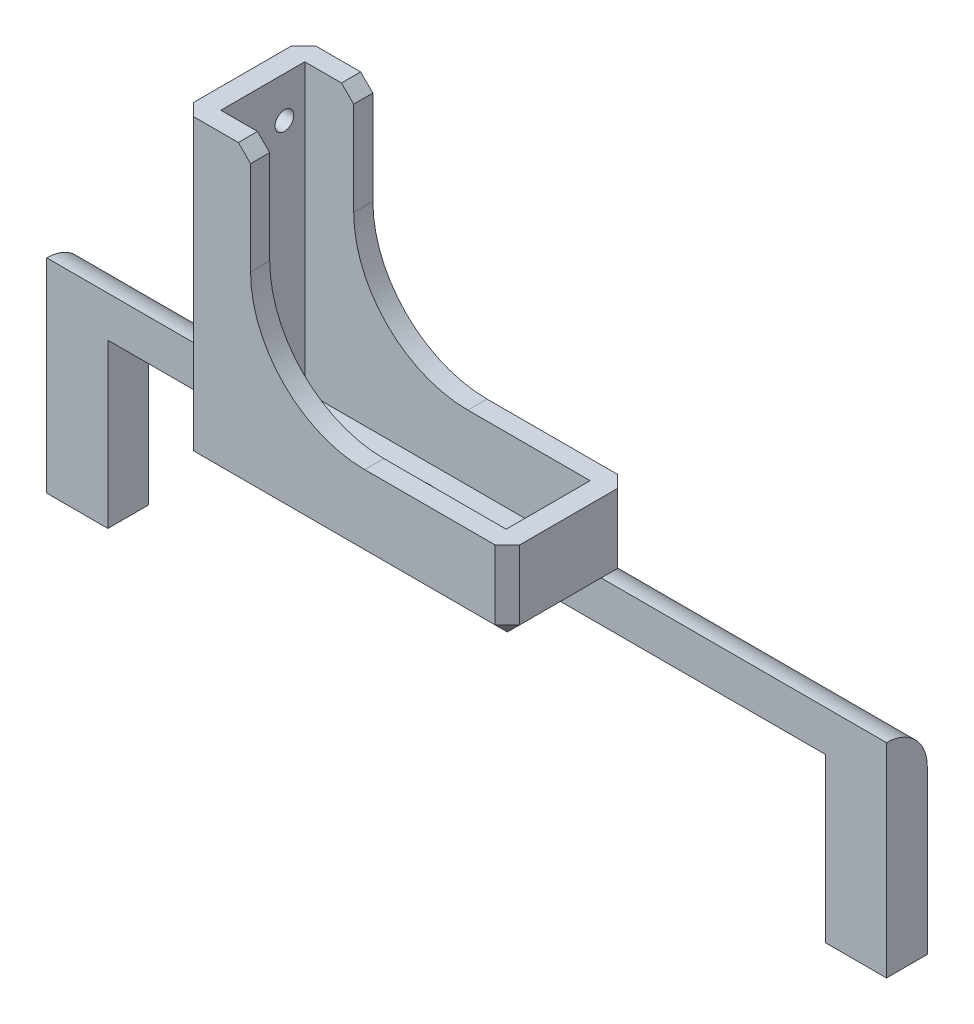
from build123d import *

# Parameters (mm, degrees)
SKETCH_1_W               = 15
SKETCH_1_H               = 8
EXTRUDE_1_DEPTH          = 7
SKETCH_4_W               = 40
SKETCH_4_H               = 15
EXTRUDE_3_DEPTH          = 2
SKETCH_5_W               = 40
SKETCH_5_H               = 15
SKETCH_5_W_2             = 35
SKETCH_5_H_2             = 10.3
EXTRUDE_4_DEPTH          = 35
SKETCH_6_W               = 23
SKETCH_6_H               = 27
CUT_EXTRUDE_1_DEPTH      = 49.877397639
CUT_EXTRUDE_3_REACH      = 61.034
SKETCH_8_R               = 1.15
SKETCH_9_R               = 2.5
CUT_EXTRUDE_4_DEPTH      = 0.1
SKETCH_11_W              = 8
SKETCH_11_H              = 20
EXTRUDE_6_DEPTH          = 15
CUT_EXTRUDE_5_DEPTH      = 49.877397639
CUT_EXTRUDE_5_DEPTH_BACK = 49.877397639
SKETCH_12_W              = 9
SKETCH_12_H              = 24.5
CUT_EXTRUDE_6_REACH      = 68.068
SKETCH_13_R              = 3
SKETCH_14_W              = 25.13622769
SKETCH_14_H              = 29.01993669
CUT_EXTRUDE_7_DEPTH      = 27
FILLET_1_R               = 14
CHAMFER_1_SIZE           = 1.5
SKETCH_17_W              = 8
SKETCH_17_H              = 23
CUT_EXTRUDE_8_DEPTH      = 20
EXTRUDE_7_REACH          = 53.393
SKETCH_19_R              = 3
CUT_EXTRUDE_9_DEPTH      = 10
SKETCH_20_W              = 15
SKETCH_20_H              = 5
CUT_EXTRUDE_10_DEPTH     = 20
EXTRUDE_8_DEPTH          = 44
EXTRUDE_START            = 44
EXTRUDE_9_DEPTH          = 44
SKETCH_23_W              = 7.5
SKETCH_23_H              = 5
EXTRUDE_10_DEPTH         = 20


with BuildPart() as part:
    # Sketch 1 → Extrude 1 (new body)
    with BuildSketch(Plane(origin=(0, 0, 0), x_dir=(1, 0, 0), z_dir=(0, 1, 0))):
        Rectangle(SKETCH_1_W, SKETCH_1_H)
    extrude(amount=EXTRUDE_1_DEPTH)

    # Sketch 4 → Extrude 3 (add)
    with BuildSketch(Plane(origin=(0, 7, 0), x_dir=(1, 0, 0), z_dir=(0, 1, 0))):
        with Locations((0, -3.5)):
            Rectangle(SKETCH_4_W, SKETCH_4_H)
    extrude(amount=-EXTRUDE_3_DEPTH)

    # Sketch 5 → Extrude 4 (add)
    with BuildSketch(Plane(origin=(0, 7, 0), x_dir=(1, 0, 0), z_dir=(0, 1, 0))):
        with Locations((0, -3.5)):
            Rectangle(SKETCH_5_W, SKETCH_5_H)
        with Locations((0, -3.5)):
            Rectangle(SKETCH_5_W_2, SKETCH_5_H_2, mode=Mode.SUBTRACT)
    extrude(amount=EXTRUDE_4_DEPTH)

    # Sketch 6 → Cut-Extrude 1 (cut, through all)
    with BuildSketch(Plane(origin=(0, 0, -4), x_dir=(-1, 0, 0), z_dir=(0, 0, -1))):
        with Locations((0, 28.5)):
            Rectangle(SKETCH_6_W, SKETCH_6_H)
    extrude(amount=-CUT_EXTRUDE_1_DEPTH, mode=Mode.SUBTRACT)

    # Sketch 8 → Cut-Extrude 3 (cut, up to next)
    with BuildSketch(Plane.ZY.offset(20), mode=Mode.PRIVATE) as cut_extrude_3_sk1:
        with Locations((0.85, 37)):
            Circle(SKETCH_8_R)
    cut_extrude_3_tool1 = extrude(cut_extrude_3_sk1.sketch, amount=-CUT_EXTRUDE_3_REACH, mode=Mode.PRIVATE) & part.part
    cut_extrude_3 = cut_extrude_3_tool1.solids().sort_by_distance((-20, 37, 0.85))[0]
    add(cut_extrude_3, mode=Mode.SUBTRACT)

    # Sketch 9 → Cut-Extrude 4 (cut)
    with BuildSketch(Plane.ZY.offset(20)):
        with Locations((0.85, 37)):
            Circle(SKETCH_9_R)
    cut_extrude_4 = extrude(amount=-CUT_EXTRUDE_4_DEPTH, mode=Mode.SUBTRACT)

    # Mirror 2: Cut-Extrude 3, Cut-Extrude 4 across plane
    add(cut_extrude_3.mirror(Plane(origin=(0, 0, 0), x_dir=(0, 0, 1), z_dir=(1, 0, 0))), mode=Mode.SUBTRACT)
    add(cut_extrude_4.mirror(Plane(origin=(0, 0, 0), x_dir=(0, 0, 1), z_dir=(1, 0, 0))), mode=Mode.SUBTRACT)

    # Sketch 11 → Extrude 6 (add)
    with BuildSketch(Plane.ZY.offset(7.5)):
        with Locations((0, -10)):
            Rectangle(SKETCH_11_W, SKETCH_11_H)
    extrude(amount=-EXTRUDE_6_DEPTH)

    # Sketch 12 → Cut-Extrude 5 (cut, two sides: drawn at the far end of the back side and taken through both)
    with BuildSketch(Plane(origin=(0, 0, -4), x_dir=(-1, 0, 0), z_dir=(0, 0, -1)).offset(-CUT_EXTRUDE_5_DEPTH_BACK)):
        with Locations((0, -7.25)):
            Rectangle(SKETCH_12_W, SKETCH_12_H)
    extrude(amount=CUT_EXTRUDE_5_DEPTH + CUT_EXTRUDE_5_DEPTH_BACK, mode=Mode.SUBTRACT)

    # Sketch 13 → Cut-Extrude 6 (cut, up to next)
    with BuildSketch(Plane(origin=(0, -20, 0), x_dir=(-1, 0, 0), z_dir=(0, -1, 0)), mode=Mode.PRIVATE) as cut_extrude_6_sk1:
        with Locations((0, 4)):
            Circle(SKETCH_13_R)
    cut_extrude_6_tool1 = extrude(cut_extrude_6_sk1.sketch, amount=-CUT_EXTRUDE_6_REACH, mode=Mode.PRIVATE) & part.part
    add(cut_extrude_6_tool1.solids().sort_by_distance((0, -20, -4))[0], mode=Mode.SUBTRACT)

    # Sketch 14 → Cut-Extrude 7 (cut)
    with BuildSketch(Plane(origin=(0, 42, 0), x_dir=(1, 0, 0), z_dir=(0, 1, 0))):
        with Locations((17.856096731, -2.844710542)):
            Rectangle(SKETCH_14_W, SKETCH_14_H)
    extrude(amount=-CUT_EXTRUDE_7_DEPTH, mode=Mode.SUBTRACT)

    # Fillet 1
    fillet_1_edges = [part.edges().sort_by_distance(p)[0] for p in [
        (-11.5, 15, -2.825),
        (-11.5, 15, 9.825),
    ]]
    fillet(fillet_1_edges, radius=FILLET_1_R)

    # Chamfer 1
    chamfer_1_edges = [part.edges().sort_by_distance(p)[0] for p in [
        (6, 5, 4),
        (-4.5, 5, 0),
        (4.5, 5, 0),
        (-6, 5, 4),
        (7.5, 5, 0),
        (-7.5, 5, 0),
        (-20, 23.5, -4),
        (20, 5, 3.5),
        (20, 10, -4),
        (0, 5, 11),
        (20, 10, 11),
        (-20, 5, 3.5),
        (-20, 23.5, 11),
        (-11.5, 42, -2.825),
        (-11.5, 42, 9.825),
    ]]
    chamfer(chamfer_1_edges, length=CHAMFER_1_SIZE)

    # Sketch 17 → Cut-Extrude 8 (cut)
    with BuildSketch(Plane(origin=(7.5, 0, 0), x_dir=(0, 0, -1), z_dir=(1, 0, 0))):
        with Locations((0, -8.5)):
            Rectangle(SKETCH_17_W, SKETCH_17_H)
    extrude(amount=-CUT_EXTRUDE_8_DEPTH, mode=Mode.SUBTRACT)

    # Extrude 7: up to this face of the body (flat: up to its plane)
    extrude_7_end = Plane(part.part.faces().sort_by_distance((-7.5, 3.25, 0))[0])
    # Sketch 18 → Extrude 7 (add, up to the picked face)
    with BuildSketch(Plane(origin=(7.5, 0, 0), x_dir=(0, 0, -1), z_dir=(1, 0, 0)), mode=Mode.PRIVATE) as extrude_7_sk1:
        with BuildLine():
            Line((4, -22), (9, -22))
            Line((9, -22), (9, -2))
            ThreePointArc((9, -2), (7.535533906, 1.535533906), (4, 3))
            Line((4, 3), (-4, 3))
            ThreePointArc((-4, 3), (-0.313739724, 0.663360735), (4, 0))
            Line((4, 0), (4, -22))
        make_face()
    extrude_7_tool1 = split(extrude(extrude_7_sk1.sketch, amount=-EXTRUDE_7_REACH, mode=Mode.PRIVATE), bisect_by=extrude_7_end, keep=Keep.BOTH, mode=Mode.PRIVATE)
    add(extrude_7_tool1.solids().sort_by(Axis((7.5, -8.537234, -5.743708), (-1, 0, 0)))[0])

    # Sketch 19 → Cut-Extrude 9 (cut)
    with BuildSketch(Plane(origin=(0, 7, 0), x_dir=(1, 0, 0), z_dir=(0, 1, 0))):
        with Locations(Location((0, -3.597722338, 0), (0, 0, 270))):
            Circle(SKETCH_19_R)
    extrude(amount=-CUT_EXTRUDE_9_DEPTH, mode=Mode.SUBTRACT)

    # Sketch 20 → Cut-Extrude 10 (cut)
    with BuildSketch(Plane.XZ.offset(22)):
        with Locations((0, -6.5)):
            Rectangle(SKETCH_20_W, SKETCH_20_H)
    extrude(amount=-CUT_EXTRUDE_10_DEPTH, mode=Mode.SUBTRACT)

    # Sketch 21 → Extrude 8 (add)
    with BuildSketch(Plane.ZY.offset(7.5)):
        with BuildLine():
            Line((-4, 3), (-4, -2))
            Line((-4, -2), (-9, -2))
            ThreePointArc((-9, -2), (-7.535533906, 1.535533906), (-4, 3))
        make_face()
    extrude(amount=EXTRUDE_8_DEPTH)

    # Sketch 22 → Extrude 9 (add)
    with BuildSketch(Plane(origin=(7.5, 0, 0), x_dir=(0, 0, -1), z_dir=(1, 0, 0)).offset(EXTRUDE_START)):
        with BuildLine():
            Line((4, -2), (9, -2))
            ThreePointArc((9, -2), (7.535533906, 1.535533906), (4, 3))
            Line((4, 3), (4, -2))
        make_face()
    extrude(amount=-EXTRUDE_9_DEPTH)

    # Sketch 23 → Extrude 10 (add)
    with BuildSketch(Plane.XZ.offset(2)):
        with Locations((-47.75, -6.5)):
            Rectangle(SKETCH_23_W, SKETCH_23_H)
        with Locations((47.75, -6.5)):
            Rectangle(SKETCH_23_W, SKETCH_23_H)
    extrude(amount=EXTRUDE_10_DEPTH)


solid = part.part
